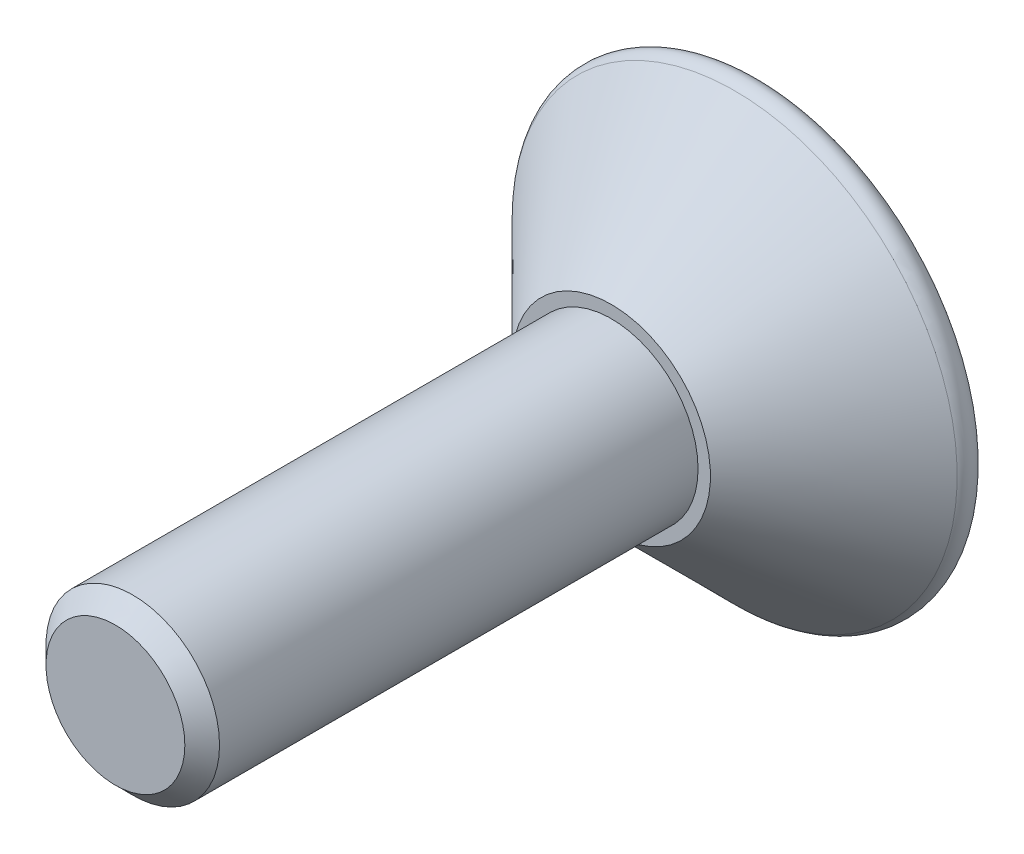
ISO-10303-21;
HEADER;
FILE_DESCRIPTION(('STEP AP214'),'2;1');
FILE_NAME('part.step','',(''),(''),'','','');
FILE_SCHEMA(('AUTOMOTIVE_DESIGN { 1 0 10303 214 1 1 1 1 }'));
ENDSEC;
DATA;
#1=APPLICATION_CONTEXT('core data for automotive mechanical design processes');
#2=APPLICATION_PROTOCOL_DEFINITION('international standard','automotive_design',2000,#1);
#3=PRODUCT_CONTEXT('',#1,'mechanical');
#4=PRODUCT('Part','Part','',(#3));
#5=PRODUCT_RELATED_PRODUCT_CATEGORY('part','',(#4));
#6=PRODUCT_DEFINITION_FORMATION('','',#4);
#7=PRODUCT_DEFINITION_CONTEXT('part definition',#1,'design');
#8=PRODUCT_DEFINITION('design','',#6,#7);
#9=PRODUCT_DEFINITION_SHAPE('','',#8);
#10=(LENGTH_UNIT() NAMED_UNIT(*) SI_UNIT(.MILLI.,.METRE.));
#11=(NAMED_UNIT(*) PLANE_ANGLE_UNIT() SI_UNIT($,.RADIAN.));
#12=(NAMED_UNIT(*) SI_UNIT($,.STERADIAN.) SOLID_ANGLE_UNIT());
#13=UNCERTAINTY_MEASURE_WITH_UNIT(LENGTH_MEASURE(1.E-05),#10,'distance_accuracy_value','');
#14=(GEOMETRIC_REPRESENTATION_CONTEXT(3) GLOBAL_UNCERTAINTY_ASSIGNED_CONTEXT((#13)) GLOBAL_UNIT_ASSIGNED_CONTEXT((#10,
#11,#12)) REPRESENTATION_CONTEXT('',''));
#15=CARTESIAN_POINT('',(0.,0.,0.));
#16=DIRECTION('',(0.,0.,1.));
#17=DIRECTION('',(1.,0.,0.));
#18=AXIS2_PLACEMENT_3D('',#15,#16,#17);
#19=CARTESIAN_POINT('',(0.,0.,-3.));
#20=DIRECTION('',(0.,0.,1.));
#21=DIRECTION('',(1.,0.,0.));
#22=AXIS2_PLACEMENT_3D('',#19,#20,#21);
#23=PLANE('',#22);
#24=CARTESIAN_POINT('',(0.,0.,-3.));
#25=DIRECTION('',(0.,0.,-1.));
#26=DIRECTION('',(-1.,0.,0.));
#27=AXIS2_PLACEMENT_3D('',#24,#25,#26);
#28=CIRCLE('',#27,4.27573593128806);
#29=CARTESIAN_POINT('',(-4.27573593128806,0.,-3.));
#30=VERTEX_POINT('',#29);
#31=EDGE_CURVE('E131',#30,#30,#28,.T.);
#32=ORIENTED_EDGE('',*,*,#31,.T.);
#33=EDGE_LOOP('',(#32));
#34=FACE_BOUND('',#33,.T.);
#35=DIRECTION('',(-0.866025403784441,0.5,0.));
#36=VECTOR('',#35,1.);
#37=CARTESIAN_POINT('',(0.,1.44337567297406,-3.));
#38=LINE('',#37,#36);
#39=CARTESIAN_POINT('',(1.25,0.721687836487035,-3.));
#40=VERTEX_POINT('',#39);
#41=CARTESIAN_POINT('',(0.,1.44337567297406,-3.));
#42=VERTEX_POINT('',#41);
#43=EDGE_CURVE('E33',#40,#42,#38,.T.);
#44=ORIENTED_EDGE('',*,*,#43,.T.);
#45=DIRECTION('',(-0.866025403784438,-0.5,0.));
#46=VECTOR('',#45,1.);
#47=CARTESIAN_POINT('',(0.,1.44337567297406,-3.));
#48=LINE('',#47,#46);
#49=CARTESIAN_POINT('',(-1.25,0.721687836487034,-3.));
#50=VERTEX_POINT('',#49);
#51=EDGE_CURVE('E104',#42,#50,#48,.T.);
#52=ORIENTED_EDGE('',*,*,#51,.T.);
#53=DIRECTION('',(0.,-1.,0.));
#54=VECTOR('',#53,1.);
#55=CARTESIAN_POINT('',(-1.25,-0.721687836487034,-3.));
#56=LINE('',#55,#54);
#57=CARTESIAN_POINT('',(-1.25,-0.721687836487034,-3.));
#58=VERTEX_POINT('',#57);
#59=EDGE_CURVE('E108',#50,#58,#56,.T.);
#60=ORIENTED_EDGE('',*,*,#59,.T.);
#61=DIRECTION('',(0.866025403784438,-0.5,0.));
#62=VECTOR('',#61,1.);
#63=CARTESIAN_POINT('',(0.,-1.44337567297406,-3.));
#64=LINE('',#63,#62);
#65=CARTESIAN_POINT('',(0.,-1.44337567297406,-3.));
#66=VERTEX_POINT('',#65);
#67=EDGE_CURVE('E111',#58,#66,#64,.T.);
#68=ORIENTED_EDGE('',*,*,#67,.T.);
#69=DIRECTION('',(0.86602540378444,0.5,0.));
#70=VECTOR('',#69,1.);
#71=CARTESIAN_POINT('',(0.,-1.44337567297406,-3.));
#72=LINE('',#71,#70);
#73=CARTESIAN_POINT('',(1.25,-0.721687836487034,-3.));
#74=VERTEX_POINT('',#73);
#75=EDGE_CURVE('E94',#66,#74,#72,.T.);
#76=ORIENTED_EDGE('',*,*,#75,.T.);
#77=DIRECTION('',(0.,1.,0.));
#78=VECTOR('',#77,1.);
#79=CARTESIAN_POINT('',(1.25,-0.721687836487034,-3.));
#80=LINE('',#79,#78);
#81=EDGE_CURVE('E114',#74,#40,#80,.T.);
#82=ORIENTED_EDGE('',*,*,#81,.T.);
#83=EDGE_LOOP('',(#44,#52,#60,#68,#76,#82));
#84=FACE_BOUND('',#83,.T.);
#85=ADVANCED_FACE('F18',(#34,#84),#23,.F.);
#86=CARTESIAN_POINT('',(0.,0.,-2.7));
#87=DIRECTION('',(0.,0.,-1.));
#88=DIRECTION('',(-1.,0.,0.));
#89=AXIS2_PLACEMENT_3D('',#86,#87,#88);
#90=TOROIDAL_SURFACE('',#89,4.27573593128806,0.3);
#91=ORIENTED_EDGE('',*,*,#31,.F.);
#92=EDGE_LOOP('',(#91));
#93=FACE_BOUND('',#92,.T.);
#94=CARTESIAN_POINT('',(0.,0.,-2.48786796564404));
#95=DIRECTION('',(0.,0.,-1.));
#96=DIRECTION('',(-1.,0.,0.));
#97=AXIS2_PLACEMENT_3D('',#94,#95,#96);
#98=CIRCLE('',#97,4.48786796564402);
#99=CARTESIAN_POINT('',(-4.48786796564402,0.,-2.48786796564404));
#100=VERTEX_POINT('',#99);
#101=EDGE_CURVE('E128',#100,#100,#98,.T.);
#102=ORIENTED_EDGE('',*,*,#101,.T.);
#103=EDGE_LOOP('',(#102));
#104=FACE_BOUND('',#103,.T.);
#105=ADVANCED_FACE('F150',(#93,#104),#90,.T.);
#106=CARTESIAN_POINT('',(0.,0.,0.));
#107=DIRECTION('',(0.,0.,-1.));
#108=DIRECTION('',(-1.,0.,0.));
#109=AXIS2_PLACEMENT_3D('',#106,#107,#108);
#110=CONICAL_SURFACE('',#109,2.,0.785398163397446);
#111=ORIENTED_EDGE('',*,*,#101,.F.);
#112=EDGE_LOOP('',(#111));
#113=FACE_BOUND('',#112,.T.);
#114=CARTESIAN_POINT('',(0.,0.,0.));
#115=DIRECTION('',(0.,0.,-1.));
#116=DIRECTION('',(-1.,0.,0.));
#117=AXIS2_PLACEMENT_3D('',#114,#115,#116);
#118=CIRCLE('',#117,2.);
#119=CARTESIAN_POINT('',(-2.,0.,0.));
#120=VERTEX_POINT('',#119);
#121=EDGE_CURVE('E125',#120,#120,#118,.T.);
#122=ORIENTED_EDGE('',*,*,#121,.T.);
#123=EDGE_LOOP('',(#122));
#124=FACE_BOUND('',#123,.T.);
#125=ADVANCED_FACE('F156',(#113,#124),#110,.T.);
#126=CARTESIAN_POINT('',(0.,0.,0.));
#127=DIRECTION('',(0.,0.,-1.));
#128=DIRECTION('',(-1.,0.,0.));
#129=AXIS2_PLACEMENT_3D('',#126,#127,#128);
#130=PLANE('',#129);
#131=CARTESIAN_POINT('',(0.,0.,0.));
#132=DIRECTION('',(0.,0.,1.));
#133=DIRECTION('',(1.,0.,0.));
#134=AXIS2_PLACEMENT_3D('',#131,#132,#133);
#135=CIRCLE('',#134,1.75);
#136=CARTESIAN_POINT('',(1.75,0.,0.));
#137=VERTEX_POINT('',#136);
#138=EDGE_CURVE('E105',#137,#137,#135,.T.);
#139=ORIENTED_EDGE('',*,*,#138,.F.);
#140=EDGE_LOOP('',(#139));
#141=FACE_BOUND('',#140,.T.);
#142=ORIENTED_EDGE('',*,*,#121,.F.);
#143=EDGE_LOOP('',(#142));
#144=FACE_BOUND('',#143,.T.);
#145=ADVANCED_FACE('F163',(#141,#144),#130,.F.);
#146=CARTESIAN_POINT('',(0.,1.44337567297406,-1.7));
#147=DIRECTION('',(-0.5,-0.86602540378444,0.));
#148=DIRECTION('',(0.86602540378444,-0.5,0.));
#149=AXIS2_PLACEMENT_3D('',#146,#147,#148);
#150=PLANE('',#149);
#151=ORIENTED_EDGE('',*,*,#43,.F.);
#152=DIRECTION('',(0.,0.,-1.));
#153=VECTOR('',#152,1.);
#154=CARTESIAN_POINT('',(1.25,0.721687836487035,-1.7));
#155=LINE('',#154,#153);
#156=CARTESIAN_POINT('',(1.25,0.721687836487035,-1.7));
#157=VERTEX_POINT('',#156);
#158=EDGE_CURVE('E99',#157,#40,#155,.T.);
#159=ORIENTED_EDGE('',*,*,#158,.F.);
#160=DIRECTION('',(-0.866025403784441,0.5,0.));
#161=VECTOR('',#160,1.);
#162=CARTESIAN_POINT('',(0.,1.44337567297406,-1.7));
#163=LINE('',#162,#161);
#164=CARTESIAN_POINT('',(0.,1.44337567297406,-1.7));
#165=VERTEX_POINT('',#164);
#166=EDGE_CURVE('E117',#157,#165,#163,.T.);
#167=ORIENTED_EDGE('',*,*,#166,.T.);
#168=DIRECTION('',(0.,0.,-1.));
#169=VECTOR('',#168,1.);
#170=CARTESIAN_POINT('',(0.,1.44337567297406,-1.7));
#171=LINE('',#170,#169);
#172=EDGE_CURVE('E123',#165,#42,#171,.T.);
#173=ORIENTED_EDGE('',*,*,#172,.T.);
#174=EDGE_LOOP('',(#151,#159,#167,#173));
#175=FACE_BOUND('',#174,.T.);
#176=ADVANCED_FACE('F167',(#175),#150,.T.);
#177=CARTESIAN_POINT('',(0.,1.44337567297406,-1.7));
#178=DIRECTION('',(0.5,-0.866025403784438,0.));
#179=DIRECTION('',(0.866025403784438,0.5,0.));
#180=AXIS2_PLACEMENT_3D('',#177,#178,#179);
#181=PLANE('',#180);
#182=ORIENTED_EDGE('',*,*,#51,.F.);
#183=ORIENTED_EDGE('',*,*,#172,.F.);
#184=DIRECTION('',(-0.866025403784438,-0.5,0.));
#185=VECTOR('',#184,1.);
#186=CARTESIAN_POINT('',(0.,1.44337567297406,-1.7));
#187=LINE('',#186,#185);
#188=CARTESIAN_POINT('',(-1.25,0.721687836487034,-1.7));
#189=VERTEX_POINT('',#188);
#190=EDGE_CURVE('E72',#165,#189,#187,.T.);
#191=ORIENTED_EDGE('',*,*,#190,.T.);
#192=DIRECTION('',(0.,0.,-1.));
#193=VECTOR('',#192,1.);
#194=CARTESIAN_POINT('',(-1.25,0.721687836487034,-1.7));
#195=LINE('',#194,#193);
#196=EDGE_CURVE('E121',#189,#50,#195,.T.);
#197=ORIENTED_EDGE('',*,*,#196,.T.);
#198=EDGE_LOOP('',(#182,#183,#191,#197));
#199=FACE_BOUND('',#198,.T.);
#200=ADVANCED_FACE('F171',(#199),#181,.T.);
#201=CARTESIAN_POINT('',(-1.25,-0.721687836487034,-1.7));
#202=DIRECTION('',(1.,0.,0.));
#203=DIRECTION('',(0.,0.,-1.));
#204=AXIS2_PLACEMENT_3D('',#201,#202,#203);
#205=PLANE('',#204);
#206=ORIENTED_EDGE('',*,*,#59,.F.);
#207=ORIENTED_EDGE('',*,*,#196,.F.);
#208=DIRECTION('',(0.,-1.,0.));
#209=VECTOR('',#208,1.);
#210=CARTESIAN_POINT('',(-1.25,-0.721687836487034,-1.7));
#211=LINE('',#210,#209);
#212=CARTESIAN_POINT('',(-1.25,-0.721687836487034,-1.7));
#213=VERTEX_POINT('',#212);
#214=EDGE_CURVE('E90',#189,#213,#211,.T.);
#215=ORIENTED_EDGE('',*,*,#214,.T.);
#216=DIRECTION('',(0.,0.,-1.));
#217=VECTOR('',#216,1.);
#218=CARTESIAN_POINT('',(-1.25,-0.721687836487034,-1.7));
#219=LINE('',#218,#217);
#220=EDGE_CURVE('E87',#213,#58,#219,.T.);
#221=ORIENTED_EDGE('',*,*,#220,.T.);
#222=EDGE_LOOP('',(#206,#207,#215,#221));
#223=FACE_BOUND('',#222,.T.);
#224=ADVANCED_FACE('F174',(#223),#205,.T.);
#225=CARTESIAN_POINT('',(0.,-1.44337567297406,-1.7));
#226=DIRECTION('',(0.5,0.866025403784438,0.));
#227=DIRECTION('',(-0.866025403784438,0.5,0.));
#228=AXIS2_PLACEMENT_3D('',#225,#226,#227);
#229=PLANE('',#228);
#230=ORIENTED_EDGE('',*,*,#67,.F.);
#231=ORIENTED_EDGE('',*,*,#220,.F.);
#232=DIRECTION('',(0.866025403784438,-0.5,0.));
#233=VECTOR('',#232,1.);
#234=CARTESIAN_POINT('',(0.,-1.44337567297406,-1.7));
#235=LINE('',#234,#233);
#236=CARTESIAN_POINT('',(0.,-1.44337567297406,-1.7));
#237=VERTEX_POINT('',#236);
#238=EDGE_CURVE('E82',#213,#237,#235,.T.);
#239=ORIENTED_EDGE('',*,*,#238,.T.);
#240=DIRECTION('',(0.,0.,-1.));
#241=VECTOR('',#240,1.);
#242=CARTESIAN_POINT('',(0.,-1.44337567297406,-1.7));
#243=LINE('',#242,#241);
#244=EDGE_CURVE('E86',#237,#66,#243,.T.);
#245=ORIENTED_EDGE('',*,*,#244,.T.);
#246=EDGE_LOOP('',(#230,#231,#239,#245));
#247=FACE_BOUND('',#246,.T.);
#248=ADVANCED_FACE('F85',(#247),#229,.T.);
#249=CARTESIAN_POINT('',(0.,-1.44337567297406,-1.7));
#250=DIRECTION('',(-0.5,0.86602540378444,0.));
#251=DIRECTION('',(-0.86602540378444,-0.5,0.));
#252=AXIS2_PLACEMENT_3D('',#249,#250,#251);
#253=PLANE('',#252);
#254=ORIENTED_EDGE('',*,*,#75,.F.);
#255=ORIENTED_EDGE('',*,*,#244,.F.);
#256=DIRECTION('',(0.86602540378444,0.5,0.));
#257=VECTOR('',#256,1.);
#258=CARTESIAN_POINT('',(0.,-1.44337567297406,-1.7));
#259=LINE('',#258,#257);
#260=CARTESIAN_POINT('',(1.25,-0.721687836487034,-1.7));
#261=VERTEX_POINT('',#260);
#262=EDGE_CURVE('E89',#237,#261,#259,.T.);
#263=ORIENTED_EDGE('',*,*,#262,.T.);
#264=DIRECTION('',(0.,0.,-1.));
#265=VECTOR('',#264,1.);
#266=CARTESIAN_POINT('',(1.25,-0.721687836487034,-1.7));
#267=LINE('',#266,#265);
#268=EDGE_CURVE('E63',#261,#74,#267,.T.);
#269=ORIENTED_EDGE('',*,*,#268,.T.);
#270=EDGE_LOOP('',(#254,#255,#263,#269));
#271=FACE_BOUND('',#270,.T.);
#272=ADVANCED_FACE('F92',(#271),#253,.T.);
#273=CARTESIAN_POINT('',(1.25,-0.721687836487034,-1.7));
#274=DIRECTION('',(-1.,0.,0.));
#275=DIRECTION('',(0.,-1.,0.));
#276=AXIS2_PLACEMENT_3D('',#273,#274,#275);
#277=PLANE('',#276);
#278=ORIENTED_EDGE('',*,*,#81,.F.);
#279=ORIENTED_EDGE('',*,*,#268,.F.);
#280=DIRECTION('',(0.,1.,0.));
#281=VECTOR('',#280,1.);
#282=CARTESIAN_POINT('',(1.25,-0.721687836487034,-1.7));
#283=LINE('',#282,#281);
#284=EDGE_CURVE('E41',#261,#157,#283,.T.);
#285=ORIENTED_EDGE('',*,*,#284,.T.);
#286=ORIENTED_EDGE('',*,*,#158,.T.);
#287=EDGE_LOOP('',(#278,#279,#285,#286));
#288=FACE_BOUND('',#287,.T.);
#289=ADVANCED_FACE('F183',(#288),#277,.T.);
#290=CARTESIAN_POINT('',(1.25,0.721687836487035,-1.7));
#291=DIRECTION('',(0.,0.,1.));
#292=DIRECTION('',(1.,0.,0.));
#293=AXIS2_PLACEMENT_3D('',#290,#291,#292);
#294=PLANE('',#293);
#295=ORIENTED_EDGE('',*,*,#166,.F.);
#296=ORIENTED_EDGE('',*,*,#284,.F.);
#297=ORIENTED_EDGE('',*,*,#262,.F.);
#298=ORIENTED_EDGE('',*,*,#238,.F.);
#299=ORIENTED_EDGE('',*,*,#214,.F.);
#300=ORIENTED_EDGE('',*,*,#190,.F.);
#301=EDGE_LOOP('',(#295,#296,#297,#298,#299,#300));
#302=FACE_BOUND('',#301,.T.);
#303=ADVANCED_FACE('F97',(#302),#294,.F.);
#304=CARTESIAN_POINT('',(0.,0.,10.));
#305=DIRECTION('',(0.,0.,1.));
#306=DIRECTION('',(1.,0.,0.));
#307=AXIS2_PLACEMENT_3D('',#304,#305,#306);
#308=PLANE('',#307);
#309=CARTESIAN_POINT('',(0.,0.,10.));
#310=DIRECTION('',(0.,0.,1.));
#311=DIRECTION('',(1.,0.,0.));
#312=AXIS2_PLACEMENT_3D('',#309,#310,#311);
#313=CIRCLE('',#312,1.4);
#314=CARTESIAN_POINT('',(1.4,0.,10.));
#315=VERTEX_POINT('',#314);
#316=EDGE_CURVE('E26',#315,#315,#313,.T.);
#317=ORIENTED_EDGE('',*,*,#316,.T.);
#318=EDGE_LOOP('',(#317));
#319=FACE_BOUND('',#318,.T.);
#320=ADVANCED_FACE('F136',(#319),#308,.T.);
#321=CARTESIAN_POINT('',(0.,0.,0.));
#322=DIRECTION('',(0.,0.,1.));
#323=DIRECTION('',(1.,0.,0.));
#324=AXIS2_PLACEMENT_3D('',#321,#322,#323);
#325=CYLINDRICAL_SURFACE('',#324,1.75);
#326=CARTESIAN_POINT('',(0.,0.,9.65));
#327=DIRECTION('',(0.,0.,1.));
#328=DIRECTION('',(1.,0.,0.));
#329=AXIS2_PLACEMENT_3D('',#326,#327,#328);
#330=CIRCLE('',#329,1.75);
#331=CARTESIAN_POINT('',(1.75,0.,9.65));
#332=VERTEX_POINT('',#331);
#333=EDGE_CURVE('E11',#332,#332,#330,.F.);
#334=ORIENTED_EDGE('',*,*,#333,.T.);
#335=EDGE_LOOP('',(#334));
#336=FACE_BOUND('',#335,.T.);
#337=ORIENTED_EDGE('',*,*,#138,.T.);
#338=EDGE_LOOP('',(#337));
#339=FACE_BOUND('',#338,.T.);
#340=ADVANCED_FACE('F139',(#336,#339),#325,.T.);
#341=CARTESIAN_POINT('',(0.,0.,10.));
#342=DIRECTION('',(0.,0.,-1.));
#343=DIRECTION('',(-1.,0.,0.));
#344=AXIS2_PLACEMENT_3D('',#341,#342,#343);
#345=CONICAL_SURFACE('',#344,1.4,0.785398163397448);
#346=ORIENTED_EDGE('',*,*,#333,.F.);
#347=EDGE_LOOP('',(#346));
#348=FACE_BOUND('',#347,.T.);
#349=ORIENTED_EDGE('',*,*,#316,.F.);
#350=EDGE_LOOP('',(#349));
#351=FACE_BOUND('',#350,.T.);
#352=ADVANCED_FACE('F20',(#348,#351),#345,.T.);
#353=CLOSED_SHELL('',(#85,#105,#125,#145,#176,#200,#224,#248,#272,#289,#303,#320,#340,#352));
#354=MANIFOLD_SOLID_BREP('B1',#353);
#355=ADVANCED_BREP_SHAPE_REPRESENTATION('',(#18,#354),#14);
#356=SHAPE_DEFINITION_REPRESENTATION(#9,#355);
ENDSEC;
END-ISO-10303-21;
